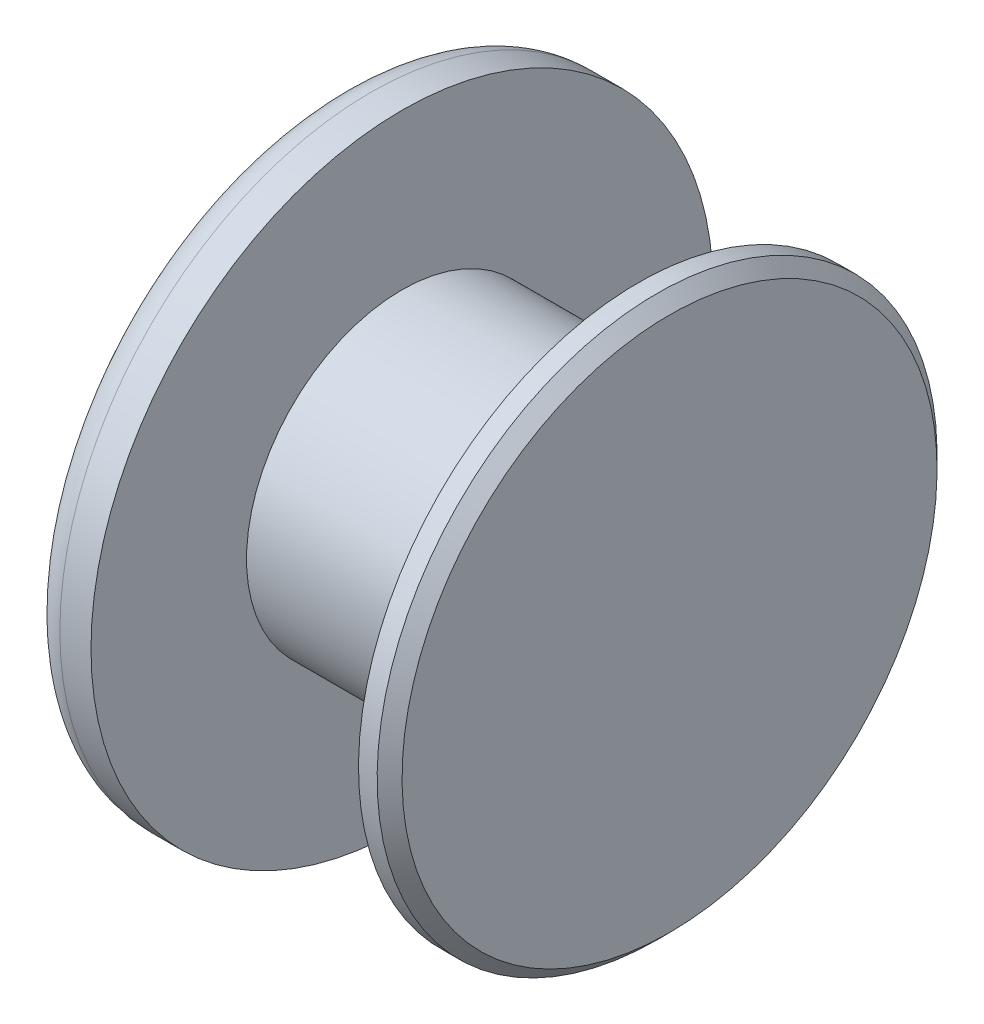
ISO-10303-21;
HEADER;
FILE_DESCRIPTION(('STEP AP214'),'2;1');
FILE_NAME('part.step','',(''),(''),'','','');
FILE_SCHEMA(('AUTOMOTIVE_DESIGN { 1 0 10303 214 1 1 1 1 }'));
ENDSEC;
DATA;
#1=APPLICATION_CONTEXT('core data for automotive mechanical design processes');
#2=APPLICATION_PROTOCOL_DEFINITION('international standard','automotive_design',2000,#1);
#3=PRODUCT_CONTEXT('',#1,'mechanical');
#4=PRODUCT('Part','Part','',(#3));
#5=PRODUCT_RELATED_PRODUCT_CATEGORY('part','',(#4));
#6=PRODUCT_DEFINITION_FORMATION('','',#4);
#7=PRODUCT_DEFINITION_CONTEXT('part definition',#1,'design');
#8=PRODUCT_DEFINITION('design','',#6,#7);
#9=PRODUCT_DEFINITION_SHAPE('','',#8);
#10=(LENGTH_UNIT() NAMED_UNIT(*) SI_UNIT(.MILLI.,.METRE.));
#11=(NAMED_UNIT(*) PLANE_ANGLE_UNIT() SI_UNIT($,.RADIAN.));
#12=(NAMED_UNIT(*) SI_UNIT($,.STERADIAN.) SOLID_ANGLE_UNIT());
#13=UNCERTAINTY_MEASURE_WITH_UNIT(LENGTH_MEASURE(1.E-05),#10,'distance_accuracy_value','');
#14=(GEOMETRIC_REPRESENTATION_CONTEXT(3) GLOBAL_UNCERTAINTY_ASSIGNED_CONTEXT((#13)) GLOBAL_UNIT_ASSIGNED_CONTEXT((#10,
#11,#12)) REPRESENTATION_CONTEXT('',''));
#15=CARTESIAN_POINT('',(0.,0.,0.));
#16=DIRECTION('',(0.,0.,1.));
#17=DIRECTION('',(1.,0.,0.));
#18=AXIS2_PLACEMENT_3D('',#15,#16,#17);
#19=CARTESIAN_POINT('',(2.65,4.5,0.));
#20=DIRECTION('',(-1.,0.,0.));
#21=DIRECTION('',(0.,-1.,0.));
#22=AXIS2_PLACEMENT_3D('',#19,#20,#21);
#23=PLANE('',#22);
#24=CARTESIAN_POINT('',(2.65,0.,0.));
#25=DIRECTION('',(-1.,0.,0.));
#26=DIRECTION('',(0.,-1.,0.));
#27=AXIS2_PLACEMENT_3D('',#24,#25,#26);
#28=CIRCLE('',#27,4.3);
#29=CARTESIAN_POINT('',(2.65,-4.3,0.));
#30=VERTEX_POINT('',#29);
#31=EDGE_CURVE('E10',#30,#30,#28,.F.);
#32=ORIENTED_EDGE('',*,*,#31,.T.);
#33=EDGE_LOOP('',(#32));
#34=FACE_BOUND('',#33,.T.);
#35=ADVANCED_FACE('F41',(#34),#23,.F.);
#36=CARTESIAN_POINT('',(-2.65,0.,0.));
#37=DIRECTION('',(1.,0.,0.));
#38=DIRECTION('',(0.,1.,0.));
#39=AXIS2_PLACEMENT_3D('',#36,#37,#38);
#40=PLANE('',#39);
#41=CARTESIAN_POINT('',(-2.65,0.,0.));
#42=DIRECTION('',(1.,0.,0.));
#43=DIRECTION('',(0.,1.,0.));
#44=AXIS2_PLACEMENT_3D('',#41,#42,#43);
#45=CIRCLE('',#44,4.5);
#46=CARTESIAN_POINT('',(-2.65,4.5,0.));
#47=VERTEX_POINT('',#46);
#48=EDGE_CURVE('E57',#47,#47,#45,.F.);
#49=ORIENTED_EDGE('',*,*,#48,.T.);
#50=EDGE_LOOP('',(#49));
#51=FACE_BOUND('',#50,.T.);
#52=ADVANCED_FACE('F90',(#51),#40,.F.);
#53=CARTESIAN_POINT('',(-2.65,0.,0.));
#54=DIRECTION('',(-1.,0.,0.));
#55=DIRECTION('',(0.,-1.,0.));
#56=AXIS2_PLACEMENT_3D('',#53,#54,#55);
#57=CYLINDRICAL_SURFACE('',#56,5.);
#58=CARTESIAN_POINT('',(-2.15,0.,0.));
#59=DIRECTION('',(1.,0.,0.));
#60=DIRECTION('',(0.,1.,0.));
#61=AXIS2_PLACEMENT_3D('',#58,#59,#60);
#62=CIRCLE('',#61,5.);
#63=CARTESIAN_POINT('',(-2.15,5.,0.));
#64=VERTEX_POINT('',#63);
#65=EDGE_CURVE('E53',#64,#64,#62,.T.);
#66=ORIENTED_EDGE('',*,*,#65,.T.);
#67=EDGE_LOOP('',(#66));
#68=FACE_BOUND('',#67,.T.);
#69=CARTESIAN_POINT('',(-1.65,0.,0.));
#70=DIRECTION('',(-1.,0.,0.));
#71=DIRECTION('',(0.,-1.,0.));
#72=AXIS2_PLACEMENT_3D('',#69,#70,#71);
#73=CIRCLE('',#72,5.);
#74=CARTESIAN_POINT('',(-1.65,-5.,0.));
#75=VERTEX_POINT('',#74);
#76=EDGE_CURVE('E62',#75,#75,#73,.T.);
#77=ORIENTED_EDGE('',*,*,#76,.T.);
#78=EDGE_LOOP('',(#77));
#79=FACE_BOUND('',#78,.T.);
#80=ADVANCED_FACE('F95',(#68,#79),#57,.T.);
#81=CARTESIAN_POINT('',(-1.65,5.,0.));
#82=DIRECTION('',(-1.,0.,0.));
#83=DIRECTION('',(0.,-1.,0.));
#84=AXIS2_PLACEMENT_3D('',#81,#82,#83);
#85=PLANE('',#84);
#86=ORIENTED_EDGE('',*,*,#76,.F.);
#87=EDGE_LOOP('',(#86));
#88=FACE_BOUND('',#87,.T.);
#89=CARTESIAN_POINT('',(-1.65,0.,0.));
#90=DIRECTION('',(-1.,0.,0.));
#91=DIRECTION('',(0.,-1.,0.));
#92=AXIS2_PLACEMENT_3D('',#89,#90,#91);
#93=CIRCLE('',#92,2.5);
#94=CARTESIAN_POINT('',(-1.65,-2.5,0.));
#95=VERTEX_POINT('',#94);
#96=EDGE_CURVE('E65',#95,#95,#93,.T.);
#97=ORIENTED_EDGE('',*,*,#96,.T.);
#98=EDGE_LOOP('',(#97));
#99=FACE_BOUND('',#98,.T.);
#100=ADVANCED_FACE('F101',(#88,#99),#85,.F.);
#101=CARTESIAN_POINT('',(-2.65,0.,0.));
#102=DIRECTION('',(-1.,0.,0.));
#103=DIRECTION('',(0.,-1.,0.));
#104=AXIS2_PLACEMENT_3D('',#101,#102,#103);
#105=CYLINDRICAL_SURFACE('',#104,2.5);
#106=ORIENTED_EDGE('',*,*,#96,.F.);
#107=EDGE_LOOP('',(#106));
#108=FACE_BOUND('',#107,.T.);
#109=CARTESIAN_POINT('',(2.15,0.,0.));
#110=DIRECTION('',(-1.,0.,0.));
#111=DIRECTION('',(0.,-1.,0.));
#112=AXIS2_PLACEMENT_3D('',#109,#110,#111);
#113=CIRCLE('',#112,2.5);
#114=CARTESIAN_POINT('',(2.15,-2.5,0.));
#115=VERTEX_POINT('',#114);
#116=EDGE_CURVE('E68',#115,#115,#113,.T.);
#117=ORIENTED_EDGE('',*,*,#116,.T.);
#118=EDGE_LOOP('',(#117));
#119=FACE_BOUND('',#118,.T.);
#120=ADVANCED_FACE('F86',(#108,#119),#105,.T.);
#121=CARTESIAN_POINT('',(2.15,2.5,0.));
#122=DIRECTION('',(1.,0.,0.));
#123=DIRECTION('',(0.,1.,0.));
#124=AXIS2_PLACEMENT_3D('',#121,#122,#123);
#125=PLANE('',#124);
#126=ORIENTED_EDGE('',*,*,#116,.F.);
#127=EDGE_LOOP('',(#126));
#128=FACE_BOUND('',#127,.T.);
#129=CARTESIAN_POINT('',(2.15,0.,0.));
#130=DIRECTION('',(-1.,0.,0.));
#131=DIRECTION('',(0.,-1.,0.));
#132=AXIS2_PLACEMENT_3D('',#129,#130,#131);
#133=CIRCLE('',#132,4.5);
#134=CARTESIAN_POINT('',(2.15,-4.5,0.));
#135=VERTEX_POINT('',#134);
#136=EDGE_CURVE('E71',#135,#135,#133,.T.);
#137=ORIENTED_EDGE('',*,*,#136,.T.);
#138=EDGE_LOOP('',(#137));
#139=FACE_BOUND('',#138,.T.);
#140=ADVANCED_FACE('F75',(#128,#139),#125,.F.);
#141=CARTESIAN_POINT('',(-2.65,0.,0.));
#142=DIRECTION('',(-1.,0.,0.));
#143=DIRECTION('',(0.,-1.,0.));
#144=AXIS2_PLACEMENT_3D('',#141,#142,#143);
#145=CYLINDRICAL_SURFACE('',#144,4.5);
#146=CARTESIAN_POINT('',(2.45,0.,0.));
#147=DIRECTION('',(-1.,0.,0.));
#148=DIRECTION('',(0.,-1.,0.));
#149=AXIS2_PLACEMENT_3D('',#146,#147,#148);
#150=CIRCLE('',#149,4.5);
#151=CARTESIAN_POINT('',(2.45000000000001,-4.5,0.));
#152=VERTEX_POINT('',#151);
#153=EDGE_CURVE('E49',#152,#152,#150,.T.);
#154=ORIENTED_EDGE('',*,*,#153,.T.);
#155=EDGE_LOOP('',(#154));
#156=FACE_BOUND('',#155,.T.);
#157=ORIENTED_EDGE('',*,*,#136,.F.);
#158=EDGE_LOOP('',(#157));
#159=FACE_BOUND('',#158,.T.);
#160=ADVANCED_FACE('F77',(#156,#159),#145,.T.);
#161=CARTESIAN_POINT('',(-2.15,0.,0.));
#162=DIRECTION('',(1.,0.,0.));
#163=DIRECTION('',(0.,1.,0.));
#164=AXIS2_PLACEMENT_3D('',#161,#162,#163);
#165=TOROIDAL_SURFACE('',#164,4.5,0.5);
#166=ORIENTED_EDGE('',*,*,#65,.F.);
#167=EDGE_LOOP('',(#166));
#168=FACE_BOUND('',#167,.T.);
#169=ORIENTED_EDGE('',*,*,#48,.F.);
#170=EDGE_LOOP('',(#169));
#171=FACE_BOUND('',#170,.T.);
#172=ADVANCED_FACE('F79',(#168,#171),#165,.T.);
#173=CARTESIAN_POINT('',(2.45,0.,0.));
#174=DIRECTION('',(-1.,0.,0.));
#175=DIRECTION('',(0.,-1.,0.));
#176=AXIS2_PLACEMENT_3D('',#173,#174,#175);
#177=CONICAL_SURFACE('',#176,4.5,0.78539816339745);
#178=ORIENTED_EDGE('',*,*,#31,.F.);
#179=EDGE_LOOP('',(#178));
#180=FACE_BOUND('',#179,.T.);
#181=ORIENTED_EDGE('',*,*,#153,.F.);
#182=EDGE_LOOP('',(#181));
#183=FACE_BOUND('',#182,.T.);
#184=ADVANCED_FACE('F44',(#180,#183),#177,.T.);
#185=CLOSED_SHELL('',(#35,#52,#80,#100,#120,#140,#160,#172,#184));
#186=MANIFOLD_SOLID_BREP('B2',#185);
#187=ADVANCED_BREP_SHAPE_REPRESENTATION('',(#18,#186),#14);
#188=SHAPE_DEFINITION_REPRESENTATION(#9,#187);
ENDSEC;
END-ISO-10303-21;
